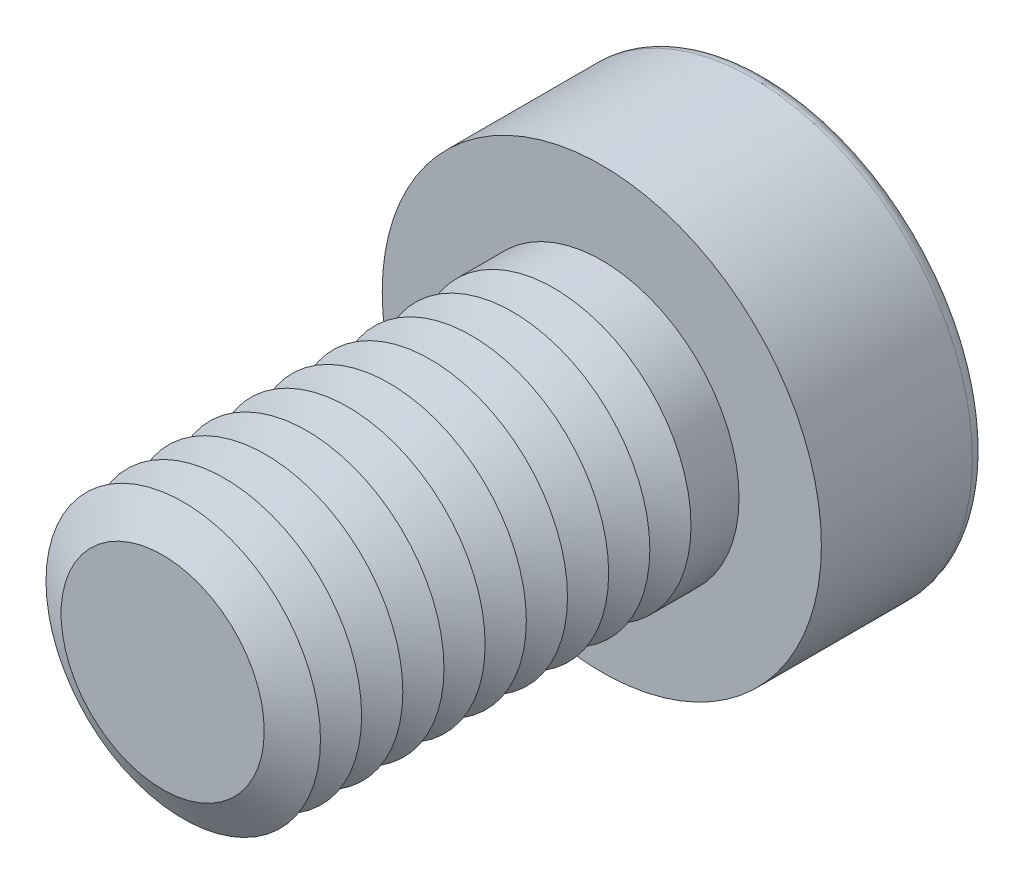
from build123d import *

# Parameters (mm, degrees)
SKETCH1_R           = 5
BOSS_EXTRUDE1_DEPTH = 16
SKETCH2_R           = 8
BOSS_EXTRUDE2_DEPTH = 6
CUT_EXTRUDE1_DEPTH  = 5.25
FILLET1_R           = 0.5
LPATTERN1_COUNT     = 10
LPATTERN1_PITCH     = 1.5


with BuildPart() as part:
    # Sketch1 → Boss-Extrude1 (new body)
    with BuildSketch(Plane.XY):
        Circle(SKETCH1_R)
    extrude(amount=BOSS_EXTRUDE1_DEPTH)

    # Sketch2 → Boss-Extrude2 (add)
    with BuildSketch(Plane(origin=(0, 0, 0), x_dir=(-1, 0, 0), z_dir=(0, 0, -1))):
        Circle(SKETCH2_R)
    extrude(amount=BOSS_EXTRUDE2_DEPTH)

    # Sketch3 → Cut-Extrude1 (cut)
    with BuildSketch(Plane(origin=(0, 0, -6), x_dir=(-1, 0, 0), z_dir=(0, 0, -1))):
        Polygon((-2.020725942, 3.5), (-4.041451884, 0), (-2.020725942, -3.5), (2.020725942, -3.5), (4.041451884, 0), (2.020725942, 3.5), align=None)
    extrude(amount=-CUT_EXTRUDE1_DEPTH, mode=Mode.SUBTRACT)

    # Fillet1
    fillet1_edges = [part.edges().sort_by_distance(p)[0] for p in [
        (8, 0, -6),
    ]]
    fillet(fillet1_edges, radius=FILLET1_R)

    # Cut-Extrude2 cone 1 section (on through the dimple's axis) → Cut-Extrude2 (revolve, cut)
    with BuildSketch(Plane(origin=(0, 0, -0.75), x_dir=(0, 1, 0), z_dir=(1, 0, 0))):
        Polygon((0, 0), (3.5, 0), (0, 2.020725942), align=None)
    revolve(axis=Axis((0, 0, -0.75), (0, 0, 1)), mode=Mode.SUBTRACT)

    # Cut-Extrude3 cone 1 section (on through the dimple's axis) → Cut-Extrude3 (revolve, cut)
    with BuildSketch(Plane(origin=(0, 0, -6), x_dir=(0, 1, 0), z_dir=(1, 0, 0))):
        Polygon((0, 0), (4.041451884, 0), (0, 1.082903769), align=None)
    revolve(axis=Axis((0, 0, -6), (0, 0, 1)), mode=Mode.SUBTRACT)

    # Sketch7 → Cut-Revolve1 (revolve, cut)
    with BuildSketch(Plane(origin=(0, 0, 0), x_dir=(0, 0, -1), z_dir=(1, 0, 0)), mode=Mode.PRIVATE) as cut_revolve1_sk:
        Polygon((-16, 3.700961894), (-15.25, 5), (-16.75, 5), align=None)
    cut_revolve1 = revolve(cut_revolve1_sk.sketch.rotate(Axis((0, 0, 16), (0, 0, -1)), 90), axis=Axis((0, 0, 16), (0, 0, -1)), mode=Mode.SUBTRACT)

    # LPattern1: Cut-Revolve1 ×10
    with Locations(*[(0, 0, -i * LPATTERN1_PITCH) for i in range(1, LPATTERN1_COUNT)]):
        add(cut_revolve1, mode=Mode.SUBTRACT)


solid = part.part
